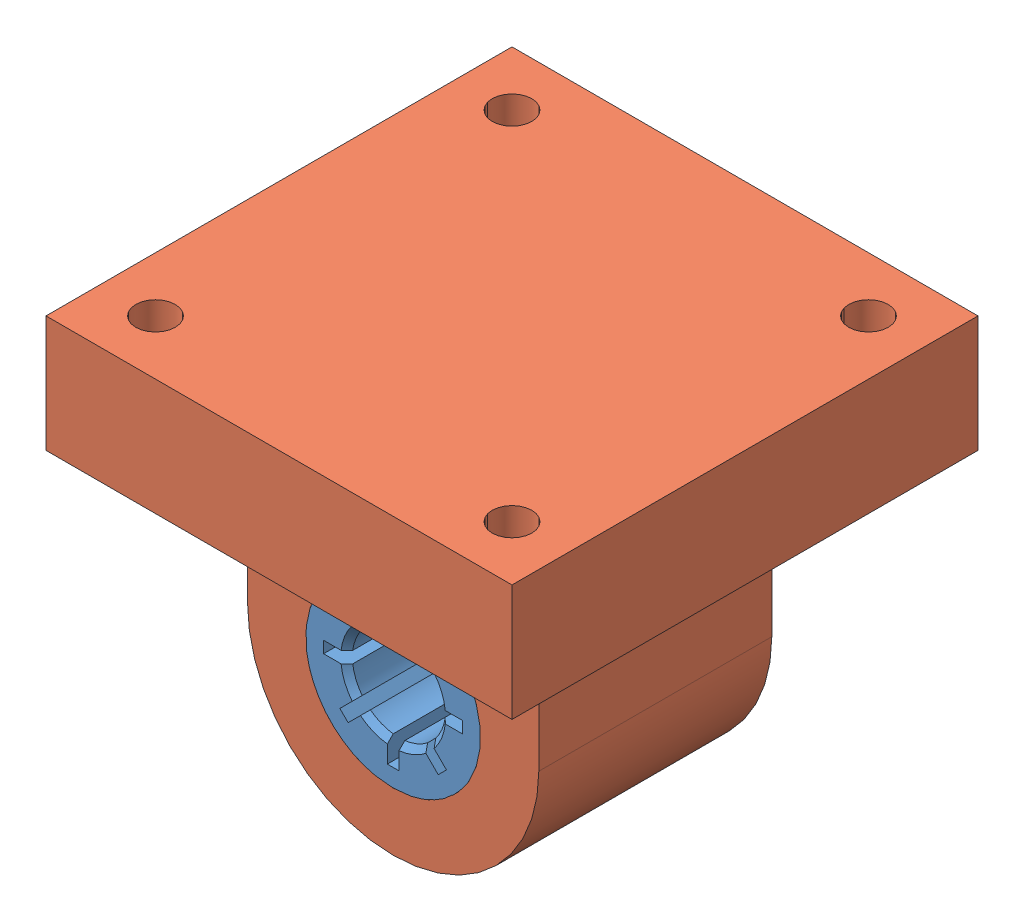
SolidWorks assembly supporto1.SLDASM, configuration Default (file format 9000). Lengths in mm.
Overall size (40 35.2 40).
2 component instances, 2 part files, 2 mates.
Components (placement in the parent):
- bearing_LM8UU_8b_15x35-1: bearing_LM8UU_8b_15x35.SLDPRT [Défaut] at (-44.9947 6.9597 0) size (15 15 20)
- supporto_asse_z-1: supporto_asse_z.SLDPRT [Default] at (-44.7947 29.6597 0) x (0 0 -1) z (0 -1 0) size (40 40 35.2)
Mates (geometry in assembly coordinates):
- Concentric1: concentric anti-aligned: cylinder of bearing_LM8UU_8b_15x35-1 through (-44.9947 6.9597 10) axis (0 0 -1) radius 7.5; cylinder of supporto_asse_z-1 through (-44.9947 6.9597 -10) axis (0 0 1) radius 7.5
- Coincident1: coincident aligned: plane of bearing_LM8UU_8b_15x35-1 through (-44.9947 6.9597 10) normal (0 0 1); plane of supporto_asse_z-1 through (-44.7947 29.6597 10) normal (0 0 1)
